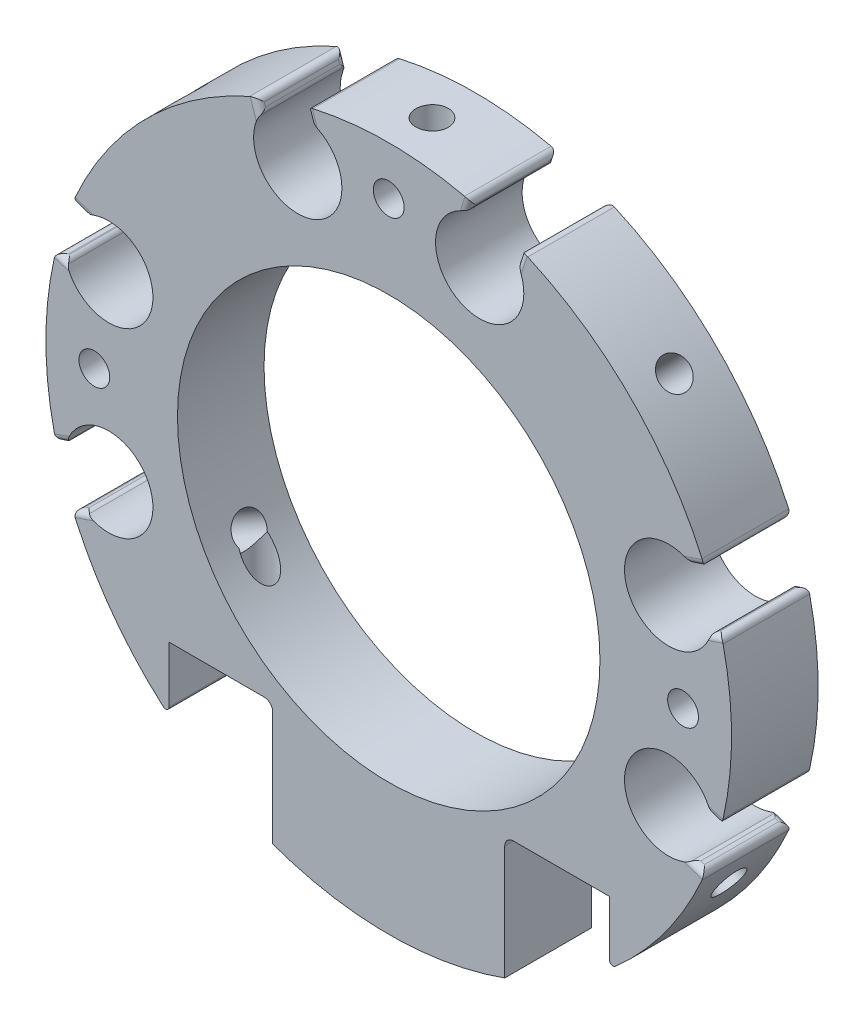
from build123d import *
from build123d.topology import SkipClean

# Parameters (mm, degrees)
SKETCH1_R                 = 25.146
BOSS_EXTRUDE1_DEPTH       = 6.35
SKETCH2_W                 = 48.957581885
SKETCH2_H                 = 12.184537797
CUT_EXTRUDE1_DEPTH        = 4.7625
SKETCH3_W                 = 10.7450563
SKETCH3_H                 = 50.385787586
CUT_EXTRUDE3_DEPTH        = 4.7625
BOSS_EXTRUDE2_START       = -4.7625
BOSS_EXTRUDE2_DEPTH       = 4.7625
F_4_40_TAPPED_HOLE1_D     = 2.2606
F_4_40_TAPPED_HOLE1_DEPTH = 12.7
F_4_40_TAPPED_HOLE1_TIP   = 0.679152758
BOSS_EXTRUDE3_DEPTH       = 6.35
BOSS_EXTRUDE4_START       = -6.35
BOSS_EXTRUDE4_DEPTH       = 6.35
BOSS_EXTRUDE7_DEPTH       = 6.35
BOSS_EXTRUDE8_DEPTH       = 6.35
CIRPATTERN1_COUNT         = 4
CIRPATTERN2_COUNT         = 2
CIRPATTERN2_ANGLE         = 18
CIRPATTERN3_COUNT         = 2
CIRPATTERN3_ANGLE         = 18
SKETCH18_W                = 32.300876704
SKETCH18_H                = 12.218364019
CUT_EXTRUDE5_DEPTH        = 36.879298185
FILLET2_R                 = 0.254
CIRPATTERN4_COUNT         = 3
CUT_EXTRUDE6_REACH        = 38.124
SKETCH22_R                = 15.494
FILLET8_R                 = 0.635
SKETCH23_R                = 3.2385
CUT_EXTRUDE7_DEPTH        = 8.89
CUT_EXTRUDE8_DEPTH        = 8.89
CIRPATTERN5_COUNT         = 4
MIRROR2_COPY_1_SKETCH_R   = 3.2385
MIRROR2_COPY_1_DEPTH      = 8.89
MIRROR2_COPY_2_SKETCH_R   = 3.2385
MIRROR2_COPY_2_DEPTH      = 8.89
MIRROR2_COPY_3_SKETCH_R   = 3.2385
MIRROR2_COPY_3_DEPTH      = 8.89
MIRROR2_COPY_4_DEPTH      = 8.89
MIRROR2_COPY_5_DEPTH      = 8.89
MIRROR2_COPY_6_DEPTH      = 8.89
F_4_40_TAPPED_HOLE4_D     = 2.2606
F_4_40_TAPPED_HOLE4_DEPTH = 19.05
CIRPATTERN6_COUNT         = 4
BOSS_EXTRUDE9_START       = -6.35
BOSS_EXTRUDE9_DEPTH       = 6.35
FILLET10_R                = 0.635
FILLET11_R                = 0.4572


with BuildPart() as part:
    # Sketch1 → Boss-Extrude1 (new body)
    with BuildSketch(Plane.XY):
        Circle(SKETCH1_R)
    extrude(amount=BOSS_EXTRUDE1_DEPTH)

    # Sketch2 → Cut-Extrude1 (cut)
    with BuildSketch(Plane.XY.offset(6.35)):
        with Locations((-0.439738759, -20.731795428)):
            Rectangle(SKETCH2_W, SKETCH2_H)
    extrude(amount=-CUT_EXTRUDE1_DEPTH, mode=Mode.SUBTRACT)

    # Sketch3 → Cut-Extrude3 (cut)
    with BuildSketch(Plane.XY.offset(6.35)):
        with Locations((24.42252815, -1.380393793)):
            Rectangle(SKETCH3_W, SKETCH3_H)
    extrude(amount=-CUT_EXTRUDE3_DEPTH, mode=Mode.SUBTRACT)

    # Sketch5 → Boss-Extrude2 (add)
    with SkipClean():  # the faces are left unmerged after this step: merging them gives an invalid solid
        with BuildSketch(Plane.XY.offset(6.35).offset(BOSS_EXTRUDE2_START)):
            with BuildLine():
                Line((16.194175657, -14.639526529), (16.194175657, -19.2372033))
                ThreePointArc((16.194175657, -19.2372033), (18.463351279, -17.071203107), (20.445184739, -14.639526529))
                Line((20.445184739, -14.639526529), (19.05, -14.639526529))
                Line((19.05, -14.639526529), (16.194175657, -14.639526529))
            make_face()
            with BuildLine():
                Line((-16.106701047, -14.639526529), (-16.106701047, -19.310502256))
                ThreePointArc((-16.106701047, -19.310502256), (-18.424564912, -17.113057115), (-20.445184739, -14.639526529))
                Line((-20.445184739, -14.639526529), (-16.106701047, -14.639526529))
            make_face()
        extrude(amount=BOSS_EXTRUDE2_DEPTH)

    # 4-40 Tapped Hole1
    with Locations(Plane(origin=(0, -14.639526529, 0), x_dir=(-1, 0, 0), z_dir=(0, -1, 0))):
        with Locations((12.7, -3.175), (-12.7, -3.175)):
            Hole(F_4_40_TAPPED_HOLE1_D / 2, depth=F_4_40_TAPPED_HOLE1_DEPTH)
            with Locations((0, 0, -(F_4_40_TAPPED_HOLE1_DEPTH + F_4_40_TAPPED_HOLE1_TIP / 2))):  # 118° drill point
                Cone(0, F_4_40_TAPPED_HOLE1_D / 2, F_4_40_TAPPED_HOLE1_TIP, mode=Mode.SUBTRACT)


with BuildPart() as body_2:
    # Sketch9 → Boss-Extrude3 (new body)
    with BuildSketch(Plane.XY.offset(6.35)):
        with BuildLine():
            Line((-14.072345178, 17.789163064), (14.072345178, 17.789163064))
            ThreePointArc((14.072345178, 17.789163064), (0, 22.682266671), (-14.072345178, 17.789163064))
        make_face()
    extrude(amount=-BOSS_EXTRUDE3_DEPTH)


with BuildPart() as part_1:
    add(part.part)

    # Combine1: union body 2
    add(body_2.part)

    # Sketch12 → Boss-Extrude4 (add)
    with SkipClean():  # the faces are left unmerged after this step: merging them gives an invalid solid
        with BuildSketch(Plane.XY.offset(6.35).offset(BOSS_EXTRUDE4_START)):
            with BuildLine():
                Line((19.05, 16.413982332), (18.126110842, 16.413982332))
                Line((18.126110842, 16.413982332), (18.126110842, -15.04550129))
                Line((18.126110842, -15.04550129), (20.148305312, -15.04550129))
                ThreePointArc((20.148305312, -15.04550129), (25.13068965, 0.877356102), (19.05, 16.413982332))
            make_face()
        boss_extrude4 = extrude(amount=BOSS_EXTRUDE4_DEPTH)

    # Mirror1: Boss-Extrude4 across plane
    add(boss_extrude4.mirror(Plane(origin=(0, 0, 0), x_dir=(0, 0, 1), z_dir=(1, 0, 0))))

    # Sketch13 → Boss-Extrude7 (add)
    with BuildSketch(Plane.XY.offset(6.35)):
        Polygon((-16.51, 16.312834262), (-16.51, -12.686084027), (-19.238969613, -12.654062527), (-19.238969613, 13.826724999), align=None)
    extrude(amount=-BOSS_EXTRUDE7_DEPTH)

    # Sketch14 → Boss-Extrude8 (add)
    with BuildSketch(Plane.XY.offset(6.35)):
        Polygon((-17.838930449, 15.24), (17.626562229, 15.24), (15.248038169, 17.278734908), (13.791227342, 18.64510529), (-12.938247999, 18.64510529), (-16.097511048, 17.022781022), align=None)
    extrude(amount=-BOSS_EXTRUDE8_DEPTH)

    # Sketch11 → 4-40 Tapped Hole2 (revolve, cut)
    with BuildSketch(Plane(origin=(0, 21.59, 6.35), x_dir=(0, -1, 0), z_dir=(1, 0, 0))):
        Polygon((0, 0), (0, 26.079152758), (1.1303, 25.4), (1.1303, 0), align=None)
    f_4_40_tapped_hole2 = revolve(axis=Axis((0, 21.59, 12.7), (0, 0, -1)), mode=Mode.SUBTRACT)

    # CirPattern1: 4-40 Tapped Hole2 ×4 about axis, 1 skipped
    cirpattern1_axis = Axis((0, 0, 0), (0, 0, 1))
    add([f_4_40_tapped_hole2.rotate(cirpattern1_axis, i * 360 / CIRPATTERN1_COUNT) for i in range(1, CIRPATTERN1_COUNT) if i not in (2,)], mode=Mode.SUBTRACT)

    # CirPattern2: 4-40 Tapped Hole2 ×2 about axis
    cirpattern2_axis = Axis((0, 0, 0), (0, 0, -1))
    for i in range(1, CIRPATTERN2_COUNT):
        add(f_4_40_tapped_hole2.rotate(cirpattern2_axis, i * CIRPATTERN2_ANGLE / (CIRPATTERN2_COUNT - 1)), mode=Mode.SUBTRACT)

    # CirPattern2 copy 1 sketch → CirPattern2 copy 1 (revolve, cut)
    with BuildSketch(Plane(origin=(-20.533310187, 6.671676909, 6.35), x_dir=(0.9510565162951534, -0.3090169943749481, 0), z_dir=(0.3090169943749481, 0.9510565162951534, 0))):
        Polygon((0, 0), (0, 26.079152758), (1.1303, 25.4), (1.1303, 0), align=None)
    revolve(axis=Axis((-20.533310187, 6.671676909, 12.7), (0, 0, -1)), mode=Mode.SUBTRACT)

    # CirPattern2 copy 2 sketch → CirPattern2 copy 2 (revolve, cut)
    with BuildSketch(Plane(origin=(20.533310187, -6.671676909, 6.35), x_dir=(-0.9510565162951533, 0.30901699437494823, 0), z_dir=(-0.30901699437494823, -0.9510565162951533, 0))):
        Polygon((0, 0), (0, 26.079152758), (1.1303, 25.4), (1.1303, 0), align=None)
    revolve(axis=Axis((20.533310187, -6.671676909, 12.7), (0, 0, -1)), mode=Mode.SUBTRACT)

    # CirPattern3: 4-40 Tapped Hole2 ×2 about axis
    cirpattern3_axis = Axis((0, 0, 0), (0, 0, 1))
    for i in range(1, CIRPATTERN3_COUNT):
        add(f_4_40_tapped_hole2.rotate(cirpattern3_axis, i * CIRPATTERN3_ANGLE / (CIRPATTERN3_COUNT - 1)), mode=Mode.SUBTRACT)

    # CirPattern3 copy 1 sketch → CirPattern3 copy 1 (revolve, cut)
    with BuildSketch(Plane(origin=(-20.533310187, -6.671676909, 6.35), x_dir=(0.9510565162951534, 0.309016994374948, 0), z_dir=(-0.309016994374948, 0.9510565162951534, 0))):
        Polygon((0, 0), (0, 26.079152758), (1.1303, 25.4), (1.1303, 0), align=None)
    revolve(axis=Axis((-20.533310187, -6.671676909, 12.7), (0, 0, -1)), mode=Mode.SUBTRACT)

    # CirPattern3 copy 2 sketch → CirPattern3 copy 2 (revolve, cut)
    with BuildSketch(Plane(origin=(20.533310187, 6.671676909, 6.35), x_dir=(-0.9510565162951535, -0.3090169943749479, 0), z_dir=(0.3090169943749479, -0.9510565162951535, 0))):
        Polygon((0, 0), (0, 26.079152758), (1.1303, 25.4), (1.1303, 0), align=None)
    revolve(axis=Axis((20.533310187, 6.671676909, 12.7), (0, 0, -1)), mode=Mode.SUBTRACT)

    # Sketch18 → Cut-Extrude5 (cut, through all)
    with BuildSketch(Plane.XY.offset(1.5875)):
        with Locations((0.043737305, -20.748708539)):
            Rectangle(SKETCH18_W, SKETCH18_H)
    extrude(amount=-CUT_EXTRUDE5_DEPTH, mode=Mode.SUBTRACT)

    # Fillet2
    fillet2_edges = [part_1.edges().sort_by_distance(p)[0] for p in [
        (16.194175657, -19.2372033, 3.96875),
        (-16.106701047, -19.310502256, 3.96875),
    ]]
    fillet(fillet2_edges, radius=FILLET2_R)

    # Sketch20 → 4-48 Tapped Hole1 (revolve, cut)
    with BuildSketch(Plane(origin=(0, 28.536426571, 3.175), x_dir=(0, 0, 1), z_dir=(1, 0, 0))):
        Polygon((0, 0), (0, 19.763491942), (1.18745, 19.05), (1.18745, 0), align=None)
    f_4_48_tapped_hole1 = revolve(axis=Axis((0, 34.886426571, 3.175), (0, -1, 0)), mode=Mode.SUBTRACT)

    # CirPattern4: 4-48 Tapped Hole1 ×3 about axis
    cirpattern4_axis = Axis((0, 0, 6.35), (0, 0, -1))
    for i in range(1, CIRPATTERN4_COUNT):
        add(f_4_48_tapped_hole1.rotate(cirpattern4_axis, i * 360 / CIRPATTERN4_COUNT), mode=Mode.SUBTRACT)

    # Sketch22 → Cut-Extrude6 (cut, up to next)
    with BuildSketch(Plane.XY.offset(6.35), mode=Mode.PRIVATE) as cut_extrude6_sk1:
        Circle(SKETCH22_R)
    cut_extrude6_tool1 = extrude(cut_extrude6_sk1.sketch, amount=-CUT_EXTRUDE6_REACH, mode=Mode.PRIVATE) & part_1.part
    add(cut_extrude6_tool1.solids().sort_by_distance((0, 0, 6.35))[0], mode=Mode.SUBTRACT)

    # Fillet8
    fillet8_edges = [part_1.edges().sort_by_distance(p)[0] for p in [
        (-5.074278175, -14.639526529, 3.96875),
        (5.074278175, -14.639526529, 3.96875),
    ]]
    fillet(fillet8_edges, radius=FILLET8_R)

    # Sketch23 → Cut-Extrude7 (cut)
    with BuildSketch(Plane.XY.offset(6.35)):
        with Locations((-6.671676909, 20.533310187)):
            Circle(SKETCH23_R)
    cut_extrude7 = extrude(amount=-CUT_EXTRUDE7_DEPTH, mode=Mode.SUBTRACT)

    # Sketch24 → Cut-Extrude8 (cut)
    with SkipClean():  # the faces are left unmerged after this step: merging them gives an invalid solid
        with BuildSketch(Plane.XY.offset(6.35)):
            Polygon((-6.424373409, 25.52968591), (-5.452283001, 22.613414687), (-9.140857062, 21.38389), (-10.112947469, 24.300161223), align=None)
        cut_extrude8 = extrude(amount=-CUT_EXTRUDE8_DEPTH, mode=Mode.SUBTRACT)

    # CirPattern5: Cut-Extrude7, Cut-Extrude8 ×4 about axis
    with SkipClean():  # the faces are left unmerged after this step: merging them gives an invalid solid
        cirpattern5_axis = Axis((0, 0, 0), (0, 0, 1))
        add([cut_extrude7.rotate(cirpattern5_axis, i * 360 / CIRPATTERN5_COUNT) for i in range(1, CIRPATTERN5_COUNT)], mode=Mode.SUBTRACT)
        add([cut_extrude8.rotate(cirpattern5_axis, i * 360 / CIRPATTERN5_COUNT) for i in range(1, CIRPATTERN5_COUNT)], mode=Mode.SUBTRACT)

    # Mirror2: Cut-Extrude7, Cut-Extrude8 across plane
    with SkipClean():  # the faces are left unmerged after this step: merging them gives an invalid solid
        add(cut_extrude7.mirror(Plane(origin=(0, 0, 0), x_dir=(0, 0, 1), z_dir=(1, 0, 0))), mode=Mode.SUBTRACT)
        add(cut_extrude8.mirror(Plane(origin=(0, 0, 0), x_dir=(0, 0, 1), z_dir=(1, 0, 0))), mode=Mode.SUBTRACT)

    # Mirror2 copy 1 sketch → Mirror2 copy 1 (cut)
    with SkipClean():  # the faces are left unmerged after this step: merging them gives an invalid solid
        with BuildSketch(Plane(origin=(0, 0, 6.35), x_dir=(0, 1, 0), z_dir=(0, 0, 1))):
            with Locations((-6.671676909, -20.533310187)):
                Circle(MIRROR2_COPY_1_SKETCH_R)
        extrude(amount=-MIRROR2_COPY_1_DEPTH, mode=Mode.SUBTRACT)

    # Mirror2 copy 2 sketch → Mirror2 copy 2 (cut)
    with SkipClean():  # the faces are left unmerged after this step: merging them gives an invalid solid
        with BuildSketch(Plane.XY.offset(6.35)):
            with Locations((-6.671676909, -20.533310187)):
                Circle(MIRROR2_COPY_2_SKETCH_R)
        extrude(amount=-MIRROR2_COPY_2_DEPTH, mode=Mode.SUBTRACT)

    # Mirror2 copy 3 sketch → Mirror2 copy 3 (cut)
    with SkipClean():  # the faces are left unmerged after this step: merging them gives an invalid solid
        with BuildSketch(Plane(origin=(0, 0, 6.35), x_dir=(0, -1, 0), z_dir=(0, 0, 1))):
            with Locations((-6.671676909, -20.533310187)):
                Circle(MIRROR2_COPY_3_SKETCH_R)
        extrude(amount=-MIRROR2_COPY_3_DEPTH, mode=Mode.SUBTRACT)

    # Mirror2 copy 4 sketch → Mirror2 copy 4 (cut)
    with SkipClean():  # the faces are left unmerged after this step: merging them gives an invalid solid
        with BuildSketch(Plane(origin=(0, 0, 6.35), x_dir=(0, 1, 0), z_dir=(0, 0, 1))):
            Polygon((-6.424373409, -25.52968591), (-5.452283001, -22.613414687), (-9.140857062, -21.38389), (-10.112947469, -24.300161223), align=None)
        extrude(amount=-MIRROR2_COPY_4_DEPTH, mode=Mode.SUBTRACT)

    # Mirror2 copy 5 sketch → Mirror2 copy 5 (cut)
    with SkipClean():  # the faces are left unmerged after this step: merging them gives an invalid solid
        with BuildSketch(Plane.XY.offset(6.35)):
            Polygon((-6.424373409, -25.52968591), (-5.452283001, -22.613414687), (-9.140857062, -21.38389), (-10.112947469, -24.300161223), align=None)
        extrude(amount=-MIRROR2_COPY_5_DEPTH, mode=Mode.SUBTRACT)

    # Mirror2 copy 6 sketch → Mirror2 copy 6 (cut)
    with SkipClean():  # the faces are left unmerged after this step: merging them gives an invalid solid
        with BuildSketch(Plane(origin=(0, 0, 6.35), x_dir=(0, -1, 0), z_dir=(0, 0, 1))):
            Polygon((-6.424373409, -25.52968591), (-5.452283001, -22.613414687), (-9.140857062, -21.38389), (-10.112947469, -24.300161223), align=None)
        extrude(amount=-MIRROR2_COPY_6_DEPTH, mode=Mode.SUBTRACT)

    # 4-40 Tapped Hole4
    with Locations(Plane(origin=(-22.170749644, 22.170749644, 3.175), x_dir=(0, 0, 1), z_dir=(-0.7071067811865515, 0.7071067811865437, 0))):
        with Locations((0, 0)):
            f_4_40_tapped_hole4 = Hole(F_4_40_TAPPED_HOLE4_D / 2, depth=F_4_40_TAPPED_HOLE4_DEPTH)

    # CirPattern6: 4-40 Tapped Hole4 ×4 about axis, 2 skipped
    with SkipClean():  # the faces are left unmerged after this step: merging them gives an invalid solid
        cirpattern6_axis = Axis((0, 0, 6.35), (0, 0, -1))
        add([f_4_40_tapped_hole4.rotate(cirpattern6_axis, i * 360 / CIRPATTERN6_COUNT) for i in range(1, CIRPATTERN6_COUNT) if i not in (2, 3)], mode=Mode.SUBTRACT)

    # Sketch28 → Boss-Extrude9 (add)
    with BuildSketch(Plane.XY.offset(6.35).offset(BOSS_EXTRUDE9_START)):
        with BuildLine():
            Line((-8.509, -12.948395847), (-8.509, -23.662591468))
            ThreePointArc((-8.509, -23.662591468), (0, -25.146), (8.509, -23.662591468))
            Line((8.509, -23.662591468), (8.509, -12.948395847))
            ThreePointArc((8.509, -12.948395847), (0, -15.494), (-8.509, -12.948395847))
        make_face()
    extrude(amount=BOSS_EXTRUDE9_DEPTH)

    # Fillet10
    fillet10_edges = [part_1.edges().sort_by_distance(p)[0] for p in [
        (8.509, -14.639526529, 3.175),
        (-8.509, -14.639526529, 3.96875),
    ]]
    fillet(fillet10_edges, radius=FILLET10_R)

    # Fillet11
    fillet11_edges = [part_1.edges().sort_by_distance(p)[0] for p in [
        (-9.425435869, 22.237626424, 3.175),
        (-5.798429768, 23.651854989, 3.175),
        (-5.924335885, 24.02957334, 0),
        (-6.050242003, 24.407291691, 3.175),
        (-9.740505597, 23.182835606, 3.175),
        (-9.582970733, 22.710231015, 0),
        (-9.582970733, 22.710231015, 6.35),
        (-5.924335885, 24.02957334, 6.35),
        (22.237626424, 9.425435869, 3.175),
        (23.651854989, 5.798429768, 3.175),
        (-22.237626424, -9.425435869, 3.175),
        (-23.651854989, -5.798429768, 3.175),
        (24.02957334, 5.924335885, 0),
        (24.407291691, 6.050242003, 3.96875),
        (23.182835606, 9.740505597, 3.96875),
        (22.710231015, 9.582970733, 0),
        (22.710231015, 9.582970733, 6.35),
        (24.02957334, 5.924335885, 6.35),
        (-24.02957334, -5.924335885, 0),
        (-24.407291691, -6.050242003, 3.175),
        (-23.182835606, -9.740505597, 3.175),
        (-22.710231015, -9.582970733, 0),
        (-22.710231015, -9.582970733, 6.35),
        (-24.02957334, -5.924335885, 6.35),
        (5.798429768, 23.651854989, 3.175),
        (9.425435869, 22.237626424, 3.175),
        (-23.651854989, 5.798429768, 3.175),
        (-22.237626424, 9.425435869, 3.175),
        (23.651854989, -5.798429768, 3.175),
        (22.237626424, -9.425435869, 3.175),
        (9.582970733, 22.710231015, 6.35),
        (5.924335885, 24.02957334, 6.35),
        (9.740505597, 23.182835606, 3.175),
        (9.582970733, 22.710231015, 0),
        (5.924335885, 24.02957334, 0),
        (6.050242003, 24.407291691, 3.175),
        (-22.710231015, 9.582970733, 6.35),
        (-24.02957334, 5.924335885, 6.35),
        (-23.182835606, 9.740505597, 3.175),
        (-22.710231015, 9.582970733, 0),
        (-24.02957334, 5.924335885, 0),
        (-24.407291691, 6.050242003, 3.175),
        (22.710231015, -9.582970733, 6.35),
        (24.02957334, -5.924335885, 6.35),
        (23.182835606, -9.740505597, 3.96875),
        (22.710231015, -9.582970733, 0),
        (24.02957334, -5.924335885, 0),
        (24.407291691, -6.050242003, 3.96875),
    ]]
    fillet(fillet11_edges, radius=FILLET11_R)


solid = part_1.part
